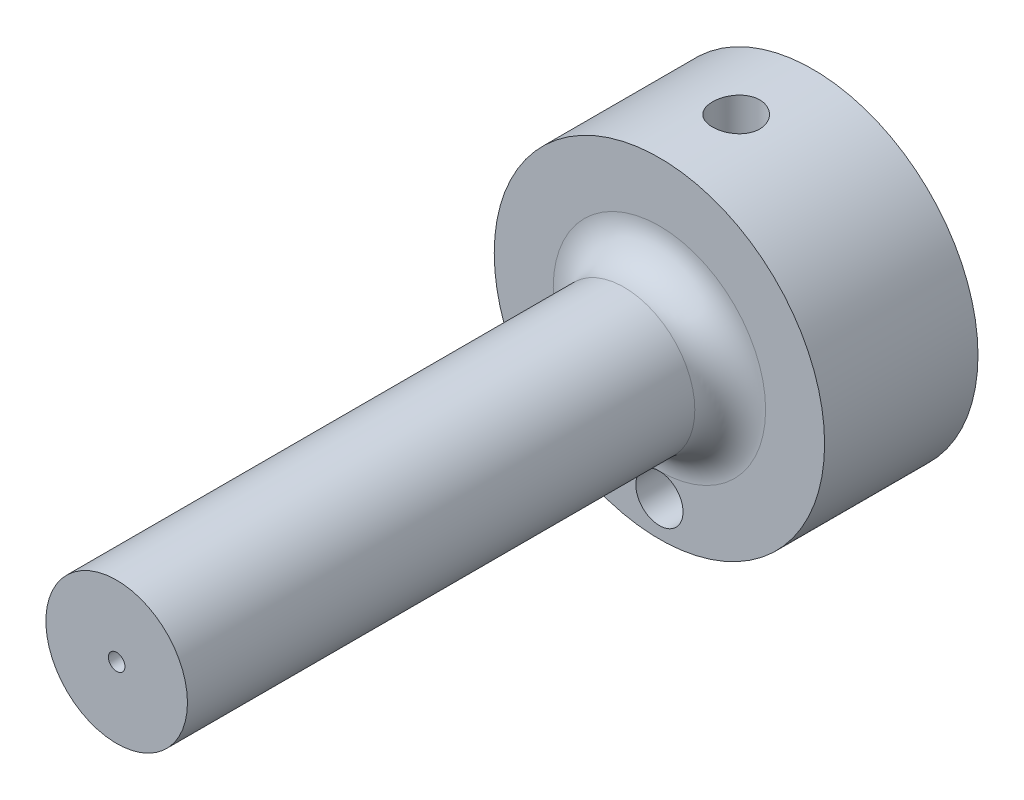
ISO-10303-21;
HEADER;
FILE_DESCRIPTION(('STEP AP214'),'2;1');
FILE_NAME('part.step','',(''),(''),'','','');
FILE_SCHEMA(('AUTOMOTIVE_DESIGN { 1 0 10303 214 1 1 1 1 }'));
ENDSEC;
DATA;
#1=APPLICATION_CONTEXT('core data for automotive mechanical design processes');
#2=APPLICATION_PROTOCOL_DEFINITION('international standard','automotive_design',2000,#1);
#3=PRODUCT_CONTEXT('',#1,'mechanical');
#4=PRODUCT('Part','Part','',(#3));
#5=PRODUCT_RELATED_PRODUCT_CATEGORY('part','',(#4));
#6=PRODUCT_DEFINITION_FORMATION('','',#4);
#7=PRODUCT_DEFINITION_CONTEXT('part definition',#1,'design');
#8=PRODUCT_DEFINITION('design','',#6,#7);
#9=PRODUCT_DEFINITION_SHAPE('','',#8);
#10=(LENGTH_UNIT() NAMED_UNIT(*) SI_UNIT(.MILLI.,.METRE.));
#11=(NAMED_UNIT(*) PLANE_ANGLE_UNIT() SI_UNIT($,.RADIAN.));
#12=(NAMED_UNIT(*) SI_UNIT($,.STERADIAN.) SOLID_ANGLE_UNIT());
#13=UNCERTAINTY_MEASURE_WITH_UNIT(LENGTH_MEASURE(1.E-05),#10,'distance_accuracy_value','');
#14=(GEOMETRIC_REPRESENTATION_CONTEXT(3) GLOBAL_UNCERTAINTY_ASSIGNED_CONTEXT((#13)) GLOBAL_UNIT_ASSIGNED_CONTEXT((#10,
#11,#12)) REPRESENTATION_CONTEXT('',''));
#15=CARTESIAN_POINT('',(0.,0.,0.));
#16=DIRECTION('',(0.,0.,1.));
#17=DIRECTION('',(1.,0.,0.));
#18=AXIS2_PLACEMENT_3D('',#15,#16,#17);
#19=CARTESIAN_POINT('',(0.,0.,46.));
#20=DIRECTION('',(0.,0.,1.));
#21=DIRECTION('',(1.,0.,0.));
#22=AXIS2_PLACEMENT_3D('',#19,#20,#21);
#23=CYLINDRICAL_SURFACE('',#22,14.);
#24=CARTESIAN_POINT('',(0.,0.,0.));
#25=DIRECTION('',(0.,0.,1.));
#26=DIRECTION('',(1.,0.,0.));
#27=AXIS2_PLACEMENT_3D('',#24,#25,#26);
#28=CIRCLE('',#27,14.);
#29=CARTESIAN_POINT('',(14.,0.,0.));
#30=VERTEX_POINT('',#29);
#31=EDGE_CURVE('E103',#30,#30,#28,.T.);
#32=ORIENTED_EDGE('',*,*,#31,.F.);
#33=EDGE_LOOP('',(#32));
#34=FACE_BOUND('',#33,.T.);
#35=CARTESIAN_POINT('',(0.,0.,-13.));
#36=DIRECTION('',(0.,0.,1.));
#37=DIRECTION('',(1.,0.,0.));
#38=AXIS2_PLACEMENT_3D('',#35,#36,#37);
#39=CIRCLE('',#38,14.);
#40=CARTESIAN_POINT('',(14.,0.,-13.));
#41=VERTEX_POINT('',#40);
#42=EDGE_CURVE('E108',#41,#41,#39,.T.);
#43=ORIENTED_EDGE('',*,*,#42,.T.);
#44=EDGE_LOOP('',(#43));
#45=FACE_BOUND('',#44,.T.);
#46=CARTESIAN_POINT('',(0.,14.,-4.5));
#47=CARTESIAN_POINT('',(0.111730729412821,13.9999982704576,-4.50000465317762));
#48=CARTESIAN_POINT('',(0.223527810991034,13.9986484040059,-4.50939441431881));
#49=CARTESIAN_POINT('',(0.444001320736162,13.9933934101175,-4.54669827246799));
#50=CARTESIAN_POINT('',(0.552674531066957,13.9894857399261,-4.57463080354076));
#51=CARTESIAN_POINT('',(0.763677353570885,13.9795546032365,-4.64817212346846));
#52=CARTESIAN_POINT('',(0.866011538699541,13.9735326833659,-4.69376799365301));
#53=CARTESIAN_POINT('',(1.06155930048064,13.9600397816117,-4.80131108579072));
#54=CARTESIAN_POINT('',(1.1547742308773,13.9525690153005,-4.86325587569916));
#55=CARTESIAN_POINT('',(1.33011730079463,13.9369507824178,-5.00220834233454));
#56=CARTESIAN_POINT('',(1.4121711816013,13.9287993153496,-5.07930928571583));
#57=CARTESIAN_POINT('',(1.56222258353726,13.9127699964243,-5.24618482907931));
#58=CARTESIAN_POINT('',(1.63021932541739,13.9048921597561,-5.33596013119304));
#59=CARTESIAN_POINT('',(1.75051175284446,13.8902631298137,-5.52613023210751));
#60=CARTESIAN_POINT('',(1.80273625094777,13.8835171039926,-5.62657049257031));
#61=CARTESIAN_POINT('',(1.8895469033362,13.8719696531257,-5.83490907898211));
#62=CARTESIAN_POINT('',(1.92413392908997,13.8671681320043,-5.94280703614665));
#63=CARTESIAN_POINT('',(1.97445864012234,13.8600923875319,-6.16222001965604));
#64=CARTESIAN_POINT('',(1.99032297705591,13.8578011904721,-6.27370543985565));
#65=CARTESIAN_POINT('',(2.00314420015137,13.8559538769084,-6.4977778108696));
#66=CARTESIAN_POINT('',(2.00010207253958,13.8563976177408,-6.61036470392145));
#67=CARTESIAN_POINT('',(1.97530036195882,13.8599545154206,-6.83255309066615));
#68=CARTESIAN_POINT('',(1.95368136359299,13.8630476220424,-6.94217064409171));
#69=CARTESIAN_POINT('',(1.89255944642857,13.8715234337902,-7.15620617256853));
#70=CARTESIAN_POINT('',(1.85305606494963,13.8769061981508,-7.26062401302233));
#71=CARTESIAN_POINT('',(1.75713904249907,13.8893771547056,-7.46172654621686));
#72=CARTESIAN_POINT('',(1.70066538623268,13.8964713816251,-7.55838222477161));
#73=CARTESIAN_POINT('',(1.57245369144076,13.9115614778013,-7.7408984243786));
#74=CARTESIAN_POINT('',(1.50071474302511,13.9195574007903,-7.82675830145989));
#75=CARTESIAN_POINT('',(1.34323491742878,13.935638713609,-7.98606080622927));
#76=CARTESIAN_POINT('',(1.25737307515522,13.9437242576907,-8.05938389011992));
#77=CARTESIAN_POINT('',(1.07449831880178,13.9590063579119,-8.19059700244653));
#78=CARTESIAN_POINT('',(0.97748536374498,13.9662029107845,-8.24848697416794));
#79=CARTESIAN_POINT('',(0.774962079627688,13.9789027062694,-8.34719487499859));
#80=CARTESIAN_POINT('',(0.66944745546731,13.9844050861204,-8.38800410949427));
#81=CARTESIAN_POINT('',(0.452966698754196,13.9930891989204,-8.4512909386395));
#82=CARTESIAN_POINT('',(0.342000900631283,13.9962710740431,-8.47376965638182));
#83=CARTESIAN_POINT('',(0.118800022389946,13.9999369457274,-8.49959962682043));
#84=CARTESIAN_POINT('',(0.00658433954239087,14.0004441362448,-8.5031153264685));
#85=CARTESIAN_POINT('',(-0.216834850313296,13.998766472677,-8.49135519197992));
#86=CARTESIAN_POINT('',(-0.328038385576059,13.9965816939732,-8.47607988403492));
#87=CARTESIAN_POINT('',(-0.545782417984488,13.989779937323,-8.42730805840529));
#88=CARTESIAN_POINT('',(-0.652341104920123,13.9851735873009,-8.39389114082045));
#89=CARTESIAN_POINT('',(-0.858342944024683,13.9740437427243,-8.30986826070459));
#90=CARTESIAN_POINT('',(-0.957785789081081,13.9675201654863,-8.25926155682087));
#91=CARTESIAN_POINT('',(-1.14745969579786,13.9532237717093,-8.14190618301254));
#92=CARTESIAN_POINT('',(-1.23762521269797,13.9454429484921,-8.07505257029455));
#93=CARTESIAN_POINT('',(-1.40551529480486,13.9295244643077,-7.92724792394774));
#94=CARTESIAN_POINT('',(-1.48323920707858,13.9213867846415,-7.84629615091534));
#95=CARTESIAN_POINT('',(-1.62463364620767,13.905598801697,-7.67186329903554));
#96=CARTESIAN_POINT('',(-1.68819430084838,13.8979526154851,-7.57829272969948));
#97=CARTESIAN_POINT('',(-1.79869568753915,13.8840847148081,-7.38170681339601));
#98=CARTESIAN_POINT('',(-1.84563683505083,13.8778629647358,-7.27869170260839));
#99=CARTESIAN_POINT('',(-1.92139410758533,13.8675777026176,-7.06647669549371));
#100=CARTESIAN_POINT('',(-1.95026930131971,13.8635071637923,-6.95729824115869));
#101=CARTESIAN_POINT('',(-1.98926373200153,13.8579660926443,-6.7355794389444));
#102=CARTESIAN_POINT('',(-1.99938413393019,13.8564953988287,-6.62303930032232));
#103=CARTESIAN_POINT('',(-2.00055590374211,13.8563261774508,-6.39888617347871));
#104=CARTESIAN_POINT('',(-1.99177997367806,13.8576025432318,-6.28727406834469));
#105=CARTESIAN_POINT('',(-1.955776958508,13.8627292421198,-6.06712987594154));
#106=CARTESIAN_POINT('',(-1.92854989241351,13.8665795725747,-5.95859778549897));
#107=CARTESIAN_POINT('',(-1.85647645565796,13.8764118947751,-5.74773473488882));
#108=CARTESIAN_POINT('',(-1.81164102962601,13.8823925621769,-5.64539996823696));
#109=CARTESIAN_POINT('',(-1.70564064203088,13.8958134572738,-5.4496775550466));
#110=CARTESIAN_POINT('',(-1.6444752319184,13.9032537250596,-5.35629015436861));
#111=CARTESIAN_POINT('',(-1.50691947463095,13.9188366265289,-5.18023418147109));
#112=CARTESIAN_POINT('',(-1.43040092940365,13.9269848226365,-5.09766625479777));
#113=CARTESIAN_POINT('',(-1.26458151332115,13.9430182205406,-4.94648029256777));
#114=CARTESIAN_POINT('',(-1.17527766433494,13.9509033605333,-4.87786551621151));
#115=CARTESIAN_POINT('',(-0.985903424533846,13.9655666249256,-4.75623242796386));
#116=CARTESIAN_POINT('',(-0.885781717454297,13.9723390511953,-4.70329334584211));
#117=CARTESIAN_POINT('',(-0.678021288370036,13.9839575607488,-4.6150602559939));
#118=CARTESIAN_POINT('',(-0.570390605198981,13.9888056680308,-4.57974769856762));
#119=CARTESIAN_POINT('',(-0.385211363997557,13.9949036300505,-4.53591641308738));
#120=CARTESIAN_POINT('',(-0.308813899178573,13.9968051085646,-4.52246796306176));
#121=CARTESIAN_POINT('',(-0.154954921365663,13.9993538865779,-4.5045081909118));
#122=CARTESIAN_POINT('',(-0.0774934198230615,14.0000011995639,-4.49999677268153));
#123=CARTESIAN_POINT('',(0.,14.,-4.5));
#124=B_SPLINE_CURVE_WITH_KNOTS('',3,(#46,#47,#48,#49,#50,#51,#52,#53,#54,#55,#56,#57,#58,#59,
#60,#61,#62,#63,#64,#65,#66,#67,#68,#69,#70,#71,#72,#73,#74,#75,#76,#77,#78,#79,#80,#81,#82,#83,
#84,#85,#86,#87,#88,#89,#90,#91,#92,#93,#94,#95,#96,#97,#98,#99,#100,#101,#102,#103,#104,#105,
#106,#107,#108,#109,#110,#111,#112,#113,#114,#115,#116,#117,#118,#119,#120,#121,#122,#123),
.UNSPECIFIED.,.T.,.F.,(4,2,2,2,2,2,2,2,2,2,2,2,2,2,2,2,2,2,2,2,2,2,2,2,2,2,2,2,2,2,2,2,2,2,2,2,
2,2,4),(0.,0.334909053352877,0.670151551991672,1.0051493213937,1.34009728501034,
1.67717486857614,2.01427113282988,2.35286688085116,2.69144589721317,3.02772118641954,
3.36397893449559,3.69771416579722,4.03145803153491,4.36639635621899,4.70135465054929,
5.03934756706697,5.37734172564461,5.71550772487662,6.05365300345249,6.38886112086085,
6.7240598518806,7.05779957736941,7.39155369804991,7.7275237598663,8.06351144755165,
8.40202124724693,8.74052258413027,9.0779112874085,9.41527903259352,9.74957651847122,
10.0838736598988,10.4179633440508,10.7520622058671,11.0890764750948,11.4261693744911,
11.7649380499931,12.1033494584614,12.3356358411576,12.5679197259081),.UNSPECIFIED.);
#125=CARTESIAN_POINT('',(0.,14.,-4.5));
#126=VERTEX_POINT('',#125);
#127=EDGE_CURVE('E11',#126,#126,#124,.T.);
#128=ORIENTED_EDGE('',*,*,#127,.F.);
#129=EDGE_LOOP('',(#128));
#130=FACE_BOUND('',#129,.T.);
#131=ADVANCED_FACE('F34',(#34,#45,#130),#23,.T.);
#132=CARTESIAN_POINT('',(0.,5.99999999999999,46.));
#133=DIRECTION('',(0.,0.,-1.));
#134=DIRECTION('',(-1.,0.,0.));
#135=AXIS2_PLACEMENT_3D('',#132,#133,#134);
#136=PLANE('',#135);
#137=CARTESIAN_POINT('',(0.,0.,46.));
#138=DIRECTION('',(0.,0.,1.));
#139=DIRECTION('',(1.,0.,0.));
#140=AXIS2_PLACEMENT_3D('',#137,#138,#139);
#141=CIRCLE('',#140,0.7);
#142=CARTESIAN_POINT('',(0.7,0.,46.));
#143=VERTEX_POINT('',#142);
#144=EDGE_CURVE('E114',#143,#143,#141,.T.);
#145=ORIENTED_EDGE('',*,*,#144,.F.);
#146=EDGE_LOOP('',(#145));
#147=FACE_BOUND('',#146,.T.);
#148=CARTESIAN_POINT('',(0.,0.,46.));
#149=DIRECTION('',(0.,0.,1.));
#150=DIRECTION('',(1.,0.,0.));
#151=AXIS2_PLACEMENT_3D('',#148,#149,#150);
#152=CIRCLE('',#151,5.99999999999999);
#153=CARTESIAN_POINT('',(5.99999999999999,0.,46.));
#154=VERTEX_POINT('',#153);
#155=EDGE_CURVE('E46',#154,#154,#152,.T.);
#156=ORIENTED_EDGE('',*,*,#155,.T.);
#157=EDGE_LOOP('',(#156));
#158=FACE_BOUND('',#157,.T.);
#159=ADVANCED_FACE('F36',(#147,#158),#136,.F.);
#160=CARTESIAN_POINT('',(0.,0.,46.));
#161=DIRECTION('',(0.,0.,1.));
#162=DIRECTION('',(1.,0.,0.));
#163=AXIS2_PLACEMENT_3D('',#160,#161,#162);
#164=CYLINDRICAL_SURFACE('',#163,6.);
#165=ORIENTED_EDGE('',*,*,#155,.F.);
#166=EDGE_LOOP('',(#165));
#167=FACE_BOUND('',#166,.T.);
#168=CARTESIAN_POINT('',(0.,0.,3.));
#169=DIRECTION('',(0.,0.,1.));
#170=DIRECTION('',(1.,0.,0.));
#171=AXIS2_PLACEMENT_3D('',#168,#169,#170);
#172=CIRCLE('',#171,6.);
#173=CARTESIAN_POINT('',(6.,0.,3.));
#174=VERTEX_POINT('',#173);
#175=EDGE_CURVE('E99',#174,#174,#172,.T.);
#176=ORIENTED_EDGE('',*,*,#175,.T.);
#177=EDGE_LOOP('',(#176));
#178=FACE_BOUND('',#177,.T.);
#179=ADVANCED_FACE('F74',(#167,#178),#164,.T.);
#180=CARTESIAN_POINT('',(0.,0.,3.));
#181=DIRECTION('',(0.,0.,1.));
#182=DIRECTION('',(1.,0.,0.));
#183=AXIS2_PLACEMENT_3D('',#180,#181,#182);
#184=TOROIDAL_SURFACE('',#183,9.,3.);
#185=ORIENTED_EDGE('',*,*,#175,.F.);
#186=EDGE_LOOP('',(#185));
#187=FACE_BOUND('',#186,.T.);
#188=CARTESIAN_POINT('',(0.,0.,0.));
#189=DIRECTION('',(0.,0.,1.));
#190=DIRECTION('',(1.,0.,0.));
#191=AXIS2_PLACEMENT_3D('',#188,#189,#190);
#192=CIRCLE('',#191,9.00000000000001);
#193=CARTESIAN_POINT('',(0.,-9.00000000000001,0.));
#194=VERTEX_POINT('',#193);
#195=EDGE_CURVE('E100',#194,#194,#192,.T.);
#196=ORIENTED_EDGE('',*,*,#195,.T.);
#197=EDGE_LOOP('',(#196));
#198=FACE_BOUND('',#197,.T.);
#199=ADVANCED_FACE('F86',(#187,#198),#184,.F.);
#200=CARTESIAN_POINT('',(0.,14.,0.));
#201=DIRECTION('',(0.,0.,-1.));
#202=DIRECTION('',(-1.,0.,0.));
#203=AXIS2_PLACEMENT_3D('',#200,#201,#202);
#204=PLANE('',#203);
#205=ORIENTED_EDGE('',*,*,#195,.F.);
#206=CARTESIAN_POINT('',(0.,-11.,0.));
#207=DIRECTION('',(0.,0.,1.));
#208=DIRECTION('',(1.,0.,0.));
#209=AXIS2_PLACEMENT_3D('',#206,#207,#208);
#210=CIRCLE('',#209,2.);
#211=EDGE_CURVE('E51',#194,#194,#210,.T.);
#212=ORIENTED_EDGE('',*,*,#211,.F.);
#213=EDGE_LOOP('',(#205,#212));
#214=FACE_BOUND('',#213,.T.);
#215=ORIENTED_EDGE('',*,*,#31,.T.);
#216=EDGE_LOOP('',(#215));
#217=FACE_BOUND('',#216,.T.);
#218=ADVANCED_FACE('F83',(#214,#217),#204,.F.);
#219=CARTESIAN_POINT('',(0.,0.7,-13.));
#220=DIRECTION('',(0.,0.,1.));
#221=DIRECTION('',(1.,0.,0.));
#222=AXIS2_PLACEMENT_3D('',#219,#220,#221);
#223=PLANE('',#222);
#224=ORIENTED_EDGE('',*,*,#42,.F.);
#225=EDGE_LOOP('',(#224));
#226=FACE_BOUND('',#225,.T.);
#227=CARTESIAN_POINT('',(0.,0.,-13.));
#228=DIRECTION('',(0.,0.,1.));
#229=DIRECTION('',(1.,0.,0.));
#230=AXIS2_PLACEMENT_3D('',#227,#228,#229);
#231=CIRCLE('',#230,0.7);
#232=CARTESIAN_POINT('',(0.7,0.,-13.));
#233=VERTEX_POINT('',#232);
#234=EDGE_CURVE('E111',#233,#233,#231,.T.);
#235=ORIENTED_EDGE('',*,*,#234,.T.);
#236=EDGE_LOOP('',(#235));
#237=FACE_BOUND('',#236,.T.);
#238=ADVANCED_FACE('F81',(#226,#237),#223,.F.);
#239=CARTESIAN_POINT('',(0.,0.,46.));
#240=DIRECTION('',(0.,0.,1.));
#241=DIRECTION('',(1.,0.,0.));
#242=AXIS2_PLACEMENT_3D('',#239,#240,#241);
#243=CYLINDRICAL_SURFACE('',#242,0.7);
#244=ORIENTED_EDGE('',*,*,#234,.F.);
#245=EDGE_LOOP('',(#244));
#246=FACE_BOUND('',#245,.T.);
#247=ORIENTED_EDGE('',*,*,#144,.T.);
#248=EDGE_LOOP('',(#247));
#249=FACE_BOUND('',#248,.T.);
#250=ADVANCED_FACE('F130',(#246,#249),#243,.F.);
#251=CARTESIAN_POINT('',(0.,14.,-6.5));
#252=DIRECTION('',(0.,1.,0.));
#253=DIRECTION('',(0.,0.,1.));
#254=AXIS2_PLACEMENT_3D('',#251,#252,#253);
#255=CYLINDRICAL_SURFACE('',#254,2.);
#256=CARTESIAN_POINT('',(0.,8.,-6.5));
#257=DIRECTION('',(0.,1.,0.));
#258=DIRECTION('',(0.,0.,1.));
#259=AXIS2_PLACEMENT_3D('',#256,#257,#258);
#260=CIRCLE('',#259,2.);
#261=CARTESIAN_POINT('',(0.,8.,-4.5));
#262=VERTEX_POINT('',#261);
#263=EDGE_CURVE('E117',#262,#262,#260,.T.);
#264=ORIENTED_EDGE('',*,*,#263,.F.);
#265=EDGE_LOOP('',(#264));
#266=FACE_BOUND('',#265,.T.);
#267=ORIENTED_EDGE('',*,*,#127,.T.);
#268=EDGE_LOOP('',(#267));
#269=FACE_BOUND('',#268,.T.);
#270=ADVANCED_FACE('F127',(#266,#269),#255,.F.);
#271=CARTESIAN_POINT('',(0.,6.79827876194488,-6.5));
#272=DIRECTION('',(0.,1.,0.));
#273=DIRECTION('',(0.,0.,1.));
#274=AXIS2_PLACEMENT_3D('',#271,#272,#273);
#275=CONICAL_SURFACE('',#274,0.,1.02974425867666);
#276=ORIENTED_EDGE('',*,*,#263,.T.);
#277=EDGE_LOOP('',(#276));
#278=FACE_BOUND('',#277,.T.);
#279=CARTESIAN_POINT('',(0.,6.79827876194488,-6.5));
#280=VERTEX_POINT('',#279);
#281=VERTEX_LOOP('',#280);
#282=FACE_BOUND('',#281,.T.);
#283=ADVANCED_FACE('F66',(#278,#282),#275,.F.);
#284=CARTESIAN_POINT('',(0.,-11.,0.));
#285=DIRECTION('',(0.,0.,1.));
#286=DIRECTION('',(1.,0.,0.));
#287=AXIS2_PLACEMENT_3D('',#284,#285,#286);
#288=CYLINDRICAL_SURFACE('',#287,2.);
#289=ORIENTED_EDGE('',*,*,#211,.T.);
#290=EDGE_LOOP('',(#289));
#291=FACE_BOUND('',#290,.T.);
#292=CARTESIAN_POINT('',(0.,-11.,-6.00000000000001));
#293=DIRECTION('',(0.,0.,1.));
#294=DIRECTION('',(1.,0.,0.));
#295=AXIS2_PLACEMENT_3D('',#292,#293,#294);
#296=CIRCLE('',#295,2.);
#297=CARTESIAN_POINT('',(2.,-11.,-6.00000000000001));
#298=VERTEX_POINT('',#297);
#299=EDGE_CURVE('E121',#298,#298,#296,.T.);
#300=ORIENTED_EDGE('',*,*,#299,.F.);
#301=EDGE_LOOP('',(#300));
#302=FACE_BOUND('',#301,.T.);
#303=ADVANCED_FACE('F60',(#291,#302),#288,.F.);
#304=CARTESIAN_POINT('',(0.,-11.,-7.20172123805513));
#305=DIRECTION('',(0.,0.,1.));
#306=DIRECTION('',(1.,0.,0.));
#307=AXIS2_PLACEMENT_3D('',#304,#305,#306);
#308=CONICAL_SURFACE('',#307,0.,1.02974425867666);
#309=ORIENTED_EDGE('',*,*,#299,.T.);
#310=EDGE_LOOP('',(#309));
#311=FACE_BOUND('',#310,.T.);
#312=CARTESIAN_POINT('',(0.,-11.,-7.20172123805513));
#313=VERTEX_POINT('',#312);
#314=VERTEX_LOOP('',#313);
#315=FACE_BOUND('',#314,.T.);
#316=ADVANCED_FACE('F58',(#311,#315),#308,.F.);
#317=CLOSED_SHELL('',(#131,#159,#179,#199,#218,#238,#250,#270,#283,#303,#316));
#318=MANIFOLD_SOLID_BREP('B2',#317);
#319=ADVANCED_BREP_SHAPE_REPRESENTATION('',(#18,#318),#14);
#320=SHAPE_DEFINITION_REPRESENTATION(#9,#319);
ENDSEC;
END-ISO-10303-21;
